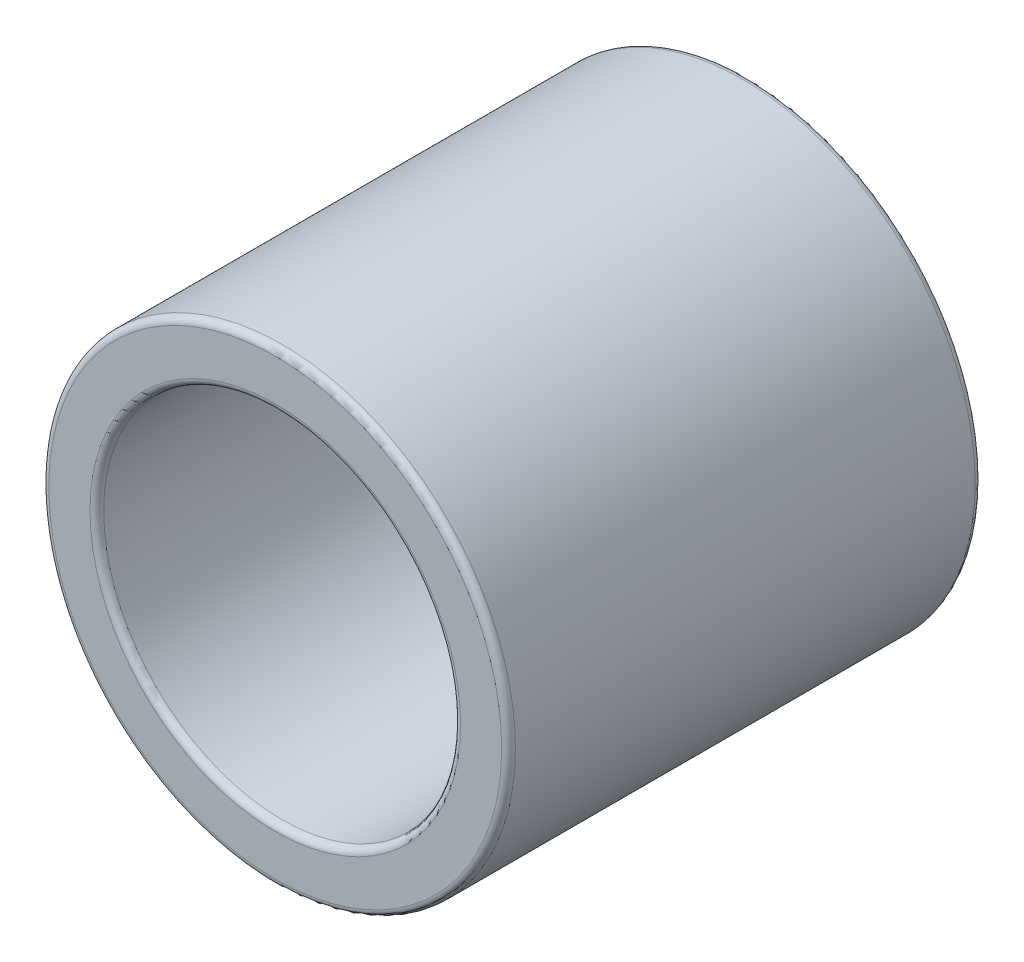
from build123d import *

# Parameters (mm, degrees)
ESQUISSE1_R      = 17
ESQUISSE1_R_2    = 13
EXTRUSION1_DEPTH = 34.5
CONG_1_R         = 0.5


with BuildPart() as part:
    # Esquisse1 → Extrusion1 (new body)
    with BuildSketch(Plane.XY):
        Circle(ESQUISSE1_R)
        Circle(ESQUISSE1_R_2, mode=Mode.SUBTRACT)
    extrude(amount=EXTRUSION1_DEPTH)

    # Cong_1
    cong_1_edges = [part.edges().sort_by_distance(p)[0] for p in [
        (-17, 0, 0),
        (-17, 0, 34.5),
        (-13, 0, 0),
        (-13, 0, 34.5),
    ]]
    fillet(cong_1_edges, radius=CONG_1_R)


solid = part.part
